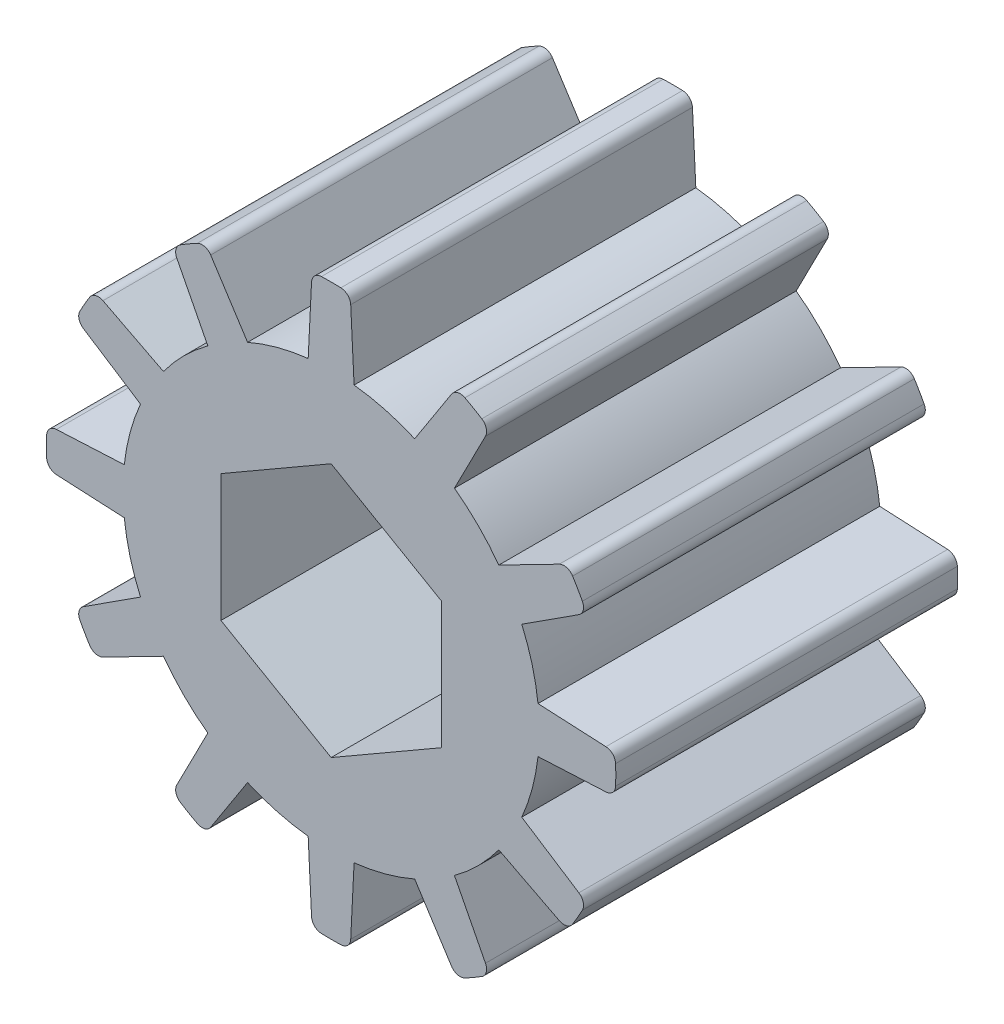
from build123d import *

# Parameters (mm, degrees)
CROQUIS1_R              = 1.85
SALIENTE_EXTRUIR1_DEPTH = 6.7
CORTAR_EXTRUIR3_DEPTH   = 11.352474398
REDONDEO1_R             = 0.2


with BuildPart() as part:
    # Croquis1 → Saliente-Extruir1 (new body)
    with BuildSketch(Plane.XY):
        with BuildLine():
            Line((0.375, 5.567875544), (0.45, 4.055600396))
            ThreePointArc((0.45, 4.055600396), (1.056108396, 3.941450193), (1.638088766, 3.737252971))
            Line((1.638088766, 3.737252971), (2.459178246, 5.009421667))
            ThreePointArc((2.459178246, 5.009421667), (2.790244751, 4.832845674), (3.108697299, 4.634421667))
            Line((3.108697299, 4.634421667), (2.41751163, 3.287252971))
            ThreePointArc((2.41751163, 3.287252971), (2.885341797, 2.885341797), (3.287252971, 2.41751163))
            Line((3.287252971, 2.41751163), (4.634421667, 3.108697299))
            ThreePointArc((4.634421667, 3.108697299), (4.832845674, 2.790244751), (5.009421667, 2.459178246))
            Line((5.009421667, 2.459178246), (3.737252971, 1.638088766))
            ThreePointArc((3.737252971, 1.638088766), (3.941450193, 1.056108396), (4.055600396, 0.45))
            Line((4.055600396, 0.45), (5.567875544, 0.375))
            ThreePointArc((5.567875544, 0.375), (5.580489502, 0), (5.567875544, -0.375))
            Line((5.567875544, -0.375), (4.055600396, -0.45))
            ThreePointArc((4.055600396, -0.45), (3.941450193, -1.056108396), (3.737252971, -1.638088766))
            Line((3.737252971, -1.638088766), (5.009421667, -2.459178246))
            ThreePointArc((5.009421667, -2.459178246), (4.832845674, -2.790244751), (4.634421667, -3.108697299))
            Line((4.634421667, -3.108697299), (3.287252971, -2.41751163))
            ThreePointArc((3.287252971, -2.41751163), (2.885341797, -2.885341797), (2.41751163, -3.287252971))
            Line((2.41751163, -3.287252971), (3.108697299, -4.634421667))
            ThreePointArc((3.108697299, -4.634421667), (2.790244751, -4.832845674), (2.459178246, -5.009421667))
            Line((2.459178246, -5.009421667), (1.638088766, -3.737252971))
            ThreePointArc((1.638088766, -3.737252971), (1.056108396, -3.941450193), (0.45, -4.055600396))
            Line((0.45, -4.055600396), (0.375, -5.567875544))
            ThreePointArc((0.375, -5.567875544), (0, -5.580489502), (-0.375, -5.567875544))
            Line((-0.375, -5.567875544), (-0.45, -4.055600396))
            ThreePointArc((-0.45, -4.055600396), (-1.056108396, -3.941450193), (-1.638088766, -3.737252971))
            Line((-1.638088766, -3.737252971), (-2.459178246, -5.009421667))
            ThreePointArc((-2.459178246, -5.009421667), (-2.790244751, -4.832845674), (-3.108697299, -4.634421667))
            Line((-3.108697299, -4.634421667), (-2.41751163, -3.287252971))
            ThreePointArc((-2.41751163, -3.287252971), (-2.885341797, -2.885341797), (-3.287252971, -2.41751163))
            Line((-3.287252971, -2.41751163), (-4.634421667, -3.108697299))
            ThreePointArc((-4.634421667, -3.108697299), (-4.832845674, -2.790244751), (-5.009421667, -2.459178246))
            Line((-5.009421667, -2.459178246), (-3.737252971, -1.638088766))
            ThreePointArc((-3.737252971, -1.638088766), (-3.941450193, -1.056108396), (-4.055600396, -0.45))
            Line((-4.055600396, -0.45), (-5.567875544, -0.375))
            ThreePointArc((-5.567875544, -0.375), (-5.580489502, 0), (-5.567875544, 0.375))
            Line((-5.567875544, 0.375), (-4.055600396, 0.45))
            ThreePointArc((-4.055600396, 0.45), (-3.941450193, 1.056108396), (-3.737252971, 1.638088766))
            Line((-3.737252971, 1.638088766), (-5.009421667, 2.459178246))
            ThreePointArc((-5.009421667, 2.459178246), (-4.832845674, 2.790244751), (-4.634421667, 3.108697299))
            Line((-4.634421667, 3.108697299), (-3.287252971, 2.41751163))
            ThreePointArc((-3.287252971, 2.41751163), (-2.885341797, 2.885341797), (-2.41751163, 3.287252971))
            Line((-2.41751163, 3.287252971), (-3.108697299, 4.634421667))
            ThreePointArc((-3.108697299, 4.634421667), (-2.790244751, 4.832845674), (-2.459178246, 5.009421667))
            Line((-2.459178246, 5.009421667), (-1.638088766, 3.737252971))
            ThreePointArc((-1.638088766, 3.737252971), (-1.056108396, 3.941450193), (-0.45, 4.055600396))
            Line((-0.45, 4.055600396), (-0.375, 5.567875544))
            ThreePointArc((-0.375, 5.567875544), (0, 5.580489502), (0.375, 5.567875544))
        make_face()
        Circle(CROQUIS1_R, mode=Mode.SUBTRACT)
    extrude(amount=SALIENTE_EXTRUIR1_DEPTH)

    # Croquis10 → Cortar-Extruir3 (cut, through all)
    with BuildSketch(Plane(origin=(0, 0, 0), x_dir=(-1, 0, 0), z_dir=(0, 0, -1))):
        Polygon((0, -2.494153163), (2.16, -1.247076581), (2.16, 1.247076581), (0, 2.494153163), (-2.16, 1.247076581), (-2.16, -1.247076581), align=None)
    extrude(amount=-CORTAR_EXTRUIR3_DEPTH, mode=Mode.SUBTRACT)

    # Redondeo1
    redondeo1_edges = [part.edges().sort_by_distance(p)[0] for p in [
        (0.375, 5.567875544, 3.35),
        (2.459178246, 5.009421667, 3.35),
        (3.108697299, 4.634421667, 3.35),
        (4.634421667, 3.108697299, 3.35),
        (5.009421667, 2.459178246, 3.35),
        (5.567875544, 0.375, 3.35),
        (5.567875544, -0.375, 3.35),
        (5.009421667, -2.459178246, 3.35),
        (4.634421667, -3.108697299, 3.35),
        (3.108697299, -4.634421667, 3.35),
        (2.459178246, -5.009421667, 3.35),
        (0.375, -5.567875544, 3.35),
        (-0.375, -5.567875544, 3.35),
        (-2.459178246, -5.009421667, 3.35),
        (-3.108697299, -4.634421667, 3.35),
        (-4.634421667, -3.108697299, 3.35),
        (-5.009421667, -2.459178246, 3.35),
        (-5.567875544, -0.375, 3.35),
        (-5.567875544, 0.375, 3.35),
        (-5.009421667, 2.459178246, 3.35),
        (-4.634421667, 3.108697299, 3.35),
        (-3.108697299, 4.634421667, 3.35),
        (-2.459178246, 5.009421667, 3.35),
        (-0.375, 5.567875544, 3.35),
    ]]
    fillet(redondeo1_edges, radius=REDONDEO1_R)


solid = part.part
